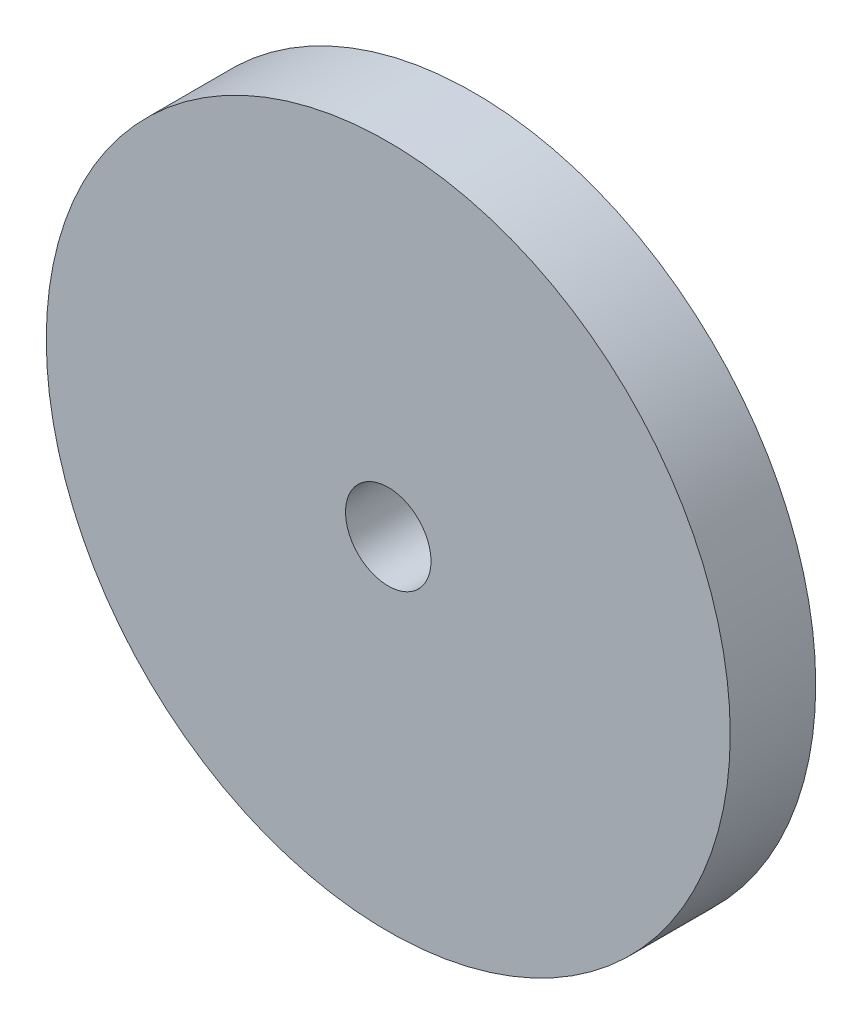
ISO-10303-21;
HEADER;
FILE_DESCRIPTION(('STEP AP214'),'2;1');
FILE_NAME('part.step','',(''),(''),'','','');
FILE_SCHEMA(('AUTOMOTIVE_DESIGN { 1 0 10303 214 1 1 1 1 }'));
ENDSEC;
DATA;
#1=APPLICATION_CONTEXT('core data for automotive mechanical design processes');
#2=APPLICATION_PROTOCOL_DEFINITION('international standard','automotive_design',2000,#1);
#3=PRODUCT_CONTEXT('',#1,'mechanical');
#4=PRODUCT('Part','Part','',(#3));
#5=PRODUCT_RELATED_PRODUCT_CATEGORY('part','',(#4));
#6=PRODUCT_DEFINITION_FORMATION('','',#4);
#7=PRODUCT_DEFINITION_CONTEXT('part definition',#1,'design');
#8=PRODUCT_DEFINITION('design','',#6,#7);
#9=PRODUCT_DEFINITION_SHAPE('','',#8);
#10=(LENGTH_UNIT() NAMED_UNIT(*) SI_UNIT(.MILLI.,.METRE.));
#11=(NAMED_UNIT(*) PLANE_ANGLE_UNIT() SI_UNIT($,.RADIAN.));
#12=(NAMED_UNIT(*) SI_UNIT($,.STERADIAN.) SOLID_ANGLE_UNIT());
#13=UNCERTAINTY_MEASURE_WITH_UNIT(LENGTH_MEASURE(1.E-05),#10,'distance_accuracy_value','');
#14=(GEOMETRIC_REPRESENTATION_CONTEXT(3) GLOBAL_UNCERTAINTY_ASSIGNED_CONTEXT((#13)) GLOBAL_UNIT_ASSIGNED_CONTEXT((#10,
#11,#12)) REPRESENTATION_CONTEXT('',''));
#15=CARTESIAN_POINT('',(0.,0.,0.));
#16=DIRECTION('',(0.,0.,1.));
#17=DIRECTION('',(1.,0.,0.));
#18=AXIS2_PLACEMENT_3D('',#15,#16,#17);
#19=CARTESIAN_POINT('',(0.,0.,3.175));
#20=DIRECTION('',(0.,0.,1.));
#21=DIRECTION('',(1.,0.,0.));
#22=AXIS2_PLACEMENT_3D('',#19,#20,#21);
#23=PLANE('',#22);
#24=CARTESIAN_POINT('',(0.,0.,3.175));
#25=DIRECTION('',(0.,0.,1.));
#26=DIRECTION('',(1.,0.,0.));
#27=AXIS2_PLACEMENT_3D('',#24,#25,#26);
#28=CIRCLE('',#27,12.7);
#29=CARTESIAN_POINT('',(12.7,0.,3.175));
#30=VERTEX_POINT('',#29);
#31=EDGE_CURVE('E10',#30,#30,#28,.T.);
#32=ORIENTED_EDGE('',*,*,#31,.T.);
#33=EDGE_LOOP('',(#32));
#34=FACE_BOUND('',#33,.T.);
#35=CARTESIAN_POINT('',(0.,0.,3.175));
#36=DIRECTION('',(0.,0.,1.));
#37=DIRECTION('',(1.,0.,0.));
#38=AXIS2_PLACEMENT_3D('',#35,#36,#37);
#39=CIRCLE('',#38,1.5875);
#40=CARTESIAN_POINT('',(1.5875,0.,3.175));
#41=VERTEX_POINT('',#40);
#42=EDGE_CURVE('E42',#41,#41,#39,.T.);
#43=ORIENTED_EDGE('',*,*,#42,.F.);
#44=EDGE_LOOP('',(#43));
#45=FACE_BOUND('',#44,.T.);
#46=ADVANCED_FACE('F31',(#34,#45),#23,.T.);
#47=CARTESIAN_POINT('',(0.,0.,0.));
#48=DIRECTION('',(0.,0.,1.));
#49=DIRECTION('',(1.,0.,0.));
#50=AXIS2_PLACEMENT_3D('',#47,#48,#49);
#51=PLANE('',#50);
#52=CARTESIAN_POINT('',(0.,0.,0.));
#53=DIRECTION('',(0.,0.,1.));
#54=DIRECTION('',(1.,0.,0.));
#55=AXIS2_PLACEMENT_3D('',#52,#53,#54);
#56=CIRCLE('',#55,12.7);
#57=CARTESIAN_POINT('',(12.7,0.,0.));
#58=VERTEX_POINT('',#57);
#59=EDGE_CURVE('E35',#58,#58,#56,.T.);
#60=ORIENTED_EDGE('',*,*,#59,.F.);
#61=EDGE_LOOP('',(#60));
#62=FACE_BOUND('',#61,.T.);
#63=CARTESIAN_POINT('',(0.,0.,0.));
#64=DIRECTION('',(0.,0.,1.));
#65=DIRECTION('',(1.,0.,0.));
#66=AXIS2_PLACEMENT_3D('',#63,#64,#65);
#67=CIRCLE('',#66,1.5875);
#68=CARTESIAN_POINT('',(1.5875,0.,0.));
#69=VERTEX_POINT('',#68);
#70=EDGE_CURVE('E44',#69,#69,#67,.T.);
#71=ORIENTED_EDGE('',*,*,#70,.T.);
#72=EDGE_LOOP('',(#71));
#73=FACE_BOUND('',#72,.T.);
#74=ADVANCED_FACE('F54',(#62,#73),#51,.F.);
#75=CARTESIAN_POINT('',(0.,0.,3.175));
#76=DIRECTION('',(0.,0.,-1.));
#77=DIRECTION('',(-1.,0.,0.));
#78=AXIS2_PLACEMENT_3D('',#75,#76,#77);
#79=CYLINDRICAL_SURFACE('',#78,12.7);
#80=ORIENTED_EDGE('',*,*,#31,.F.);
#81=EDGE_LOOP('',(#80));
#82=FACE_BOUND('',#81,.T.);
#83=ORIENTED_EDGE('',*,*,#59,.T.);
#84=EDGE_LOOP('',(#83));
#85=FACE_BOUND('',#84,.T.);
#86=ADVANCED_FACE('F33',(#82,#85),#79,.T.);
#87=CARTESIAN_POINT('',(0.,0.,3.175));
#88=DIRECTION('',(0.,0.,-1.));
#89=DIRECTION('',(-1.,0.,0.));
#90=AXIS2_PLACEMENT_3D('',#87,#88,#89);
#91=CYLINDRICAL_SURFACE('',#90,1.5875);
#92=ORIENTED_EDGE('',*,*,#42,.T.);
#93=EDGE_LOOP('',(#92));
#94=FACE_BOUND('',#93,.T.);
#95=ORIENTED_EDGE('',*,*,#70,.F.);
#96=EDGE_LOOP('',(#95));
#97=FACE_BOUND('',#96,.T.);
#98=ADVANCED_FACE('F50',(#94,#97),#91,.F.);
#99=CLOSED_SHELL('',(#46,#74,#86,#98));
#100=MANIFOLD_SOLID_BREP('B2',#99);
#101=ADVANCED_BREP_SHAPE_REPRESENTATION('',(#18,#100),#14);
#102=SHAPE_DEFINITION_REPRESENTATION(#9,#101);
ENDSEC;
END-ISO-10303-21;
